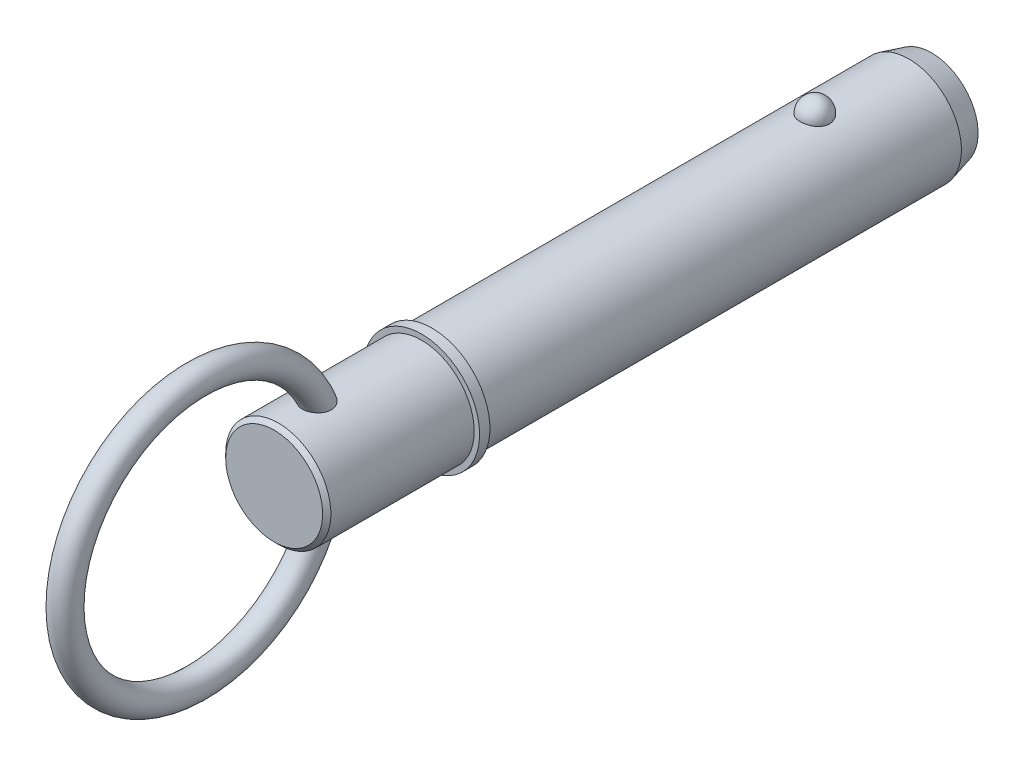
ISO-10303-21;
HEADER;
FILE_DESCRIPTION(('STEP AP214'),'2;1');
FILE_NAME('part.step','',(''),(''),'','','');
FILE_SCHEMA(('AUTOMOTIVE_DESIGN { 1 0 10303 214 1 1 1 1 }'));
ENDSEC;
DATA;
#1=APPLICATION_CONTEXT('core data for automotive mechanical design processes');
#2=APPLICATION_PROTOCOL_DEFINITION('international standard','automotive_design',2000,#1);
#3=PRODUCT_CONTEXT('',#1,'mechanical');
#4=PRODUCT('Part','Part','',(#3));
#5=PRODUCT_RELATED_PRODUCT_CATEGORY('part','',(#4));
#6=PRODUCT_DEFINITION_FORMATION('','',#4);
#7=PRODUCT_DEFINITION_CONTEXT('part definition',#1,'design');
#8=PRODUCT_DEFINITION('design','',#6,#7);
#9=PRODUCT_DEFINITION_SHAPE('','',#8);
#10=(LENGTH_UNIT() NAMED_UNIT(*) SI_UNIT(.MILLI.,.METRE.));
#11=(NAMED_UNIT(*) PLANE_ANGLE_UNIT() SI_UNIT($,.RADIAN.));
#12=(NAMED_UNIT(*) SI_UNIT($,.STERADIAN.) SOLID_ANGLE_UNIT());
#13=UNCERTAINTY_MEASURE_WITH_UNIT(LENGTH_MEASURE(1.E-05),#10,'distance_accuracy_value','');
#14=(GEOMETRIC_REPRESENTATION_CONTEXT(3) GLOBAL_UNCERTAINTY_ASSIGNED_CONTEXT((#13)) GLOBAL_UNIT_ASSIGNED_CONTEXT((#10,
#11,#12)) REPRESENTATION_CONTEXT('',''));
#15=CARTESIAN_POINT('',(0.,0.,0.));
#16=DIRECTION('',(0.,0.,1.));
#17=DIRECTION('',(1.,0.,0.));
#18=AXIS2_PLACEMENT_3D('',#15,#16,#17);
#19=CARTESIAN_POINT('',(0.,0.,88.9));
#20=DIRECTION('',(0.,0.,-1.));
#21=DIRECTION('',(-1.,0.,0.));
#22=AXIS2_PLACEMENT_3D('',#19,#20,#21);
#23=CYLINDRICAL_SURFACE('',#22,12.7);
#24=CARTESIAN_POINT('',(3.52486003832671,12.2010393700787,-3.56));
#25=CARTESIAN_POINT('',(3.52485671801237,12.2010422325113,-3.3610062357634));
#26=CARTESIAN_POINT('',(3.50863187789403,12.2057632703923,-3.16197042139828));
#27=CARTESIAN_POINT('',(3.4441205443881,12.2241207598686,-2.76953945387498));
#28=CARTESIAN_POINT('',(3.39582213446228,12.2377605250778,-2.57614642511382));
#29=CARTESIAN_POINT('',(3.26839193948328,12.2724057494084,-2.20059799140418));
#30=CARTESIAN_POINT('',(3.18927369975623,12.2934079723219,-2.01843769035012));
#31=CARTESIAN_POINT('',(3.00217139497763,12.3404306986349,-1.6703228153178));
#32=CARTESIAN_POINT('',(2.89418796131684,12.3664510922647,-1.50436788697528));
#33=CARTESIAN_POINT('',(2.65144862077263,12.4207616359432,-1.19241975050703));
#34=CARTESIAN_POINT('',(2.51656310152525,12.4490623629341,-1.04652919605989));
#35=CARTESIAN_POINT('',(2.22383249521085,12.5046678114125,-0.779711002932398));
#36=CARTESIAN_POINT('',(2.0659873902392,12.5319725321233,-0.658783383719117));
#37=CARTESIAN_POINT('',(1.73204520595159,12.5824645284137,-0.445586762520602));
#38=CARTESIAN_POINT('',(1.55600183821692,12.6056634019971,-0.353236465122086));
#39=CARTESIAN_POINT('',(1.19021695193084,12.6454411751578,-0.199381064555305));
#40=CARTESIAN_POINT('',(1.00047694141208,12.6620208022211,-0.137872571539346));
#41=CARTESIAN_POINT('',(0.616329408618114,12.6864692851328,-0.0483191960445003));
#42=CARTESIAN_POINT('',(0.422067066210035,12.6944893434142,-0.0196927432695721));
#43=CARTESIAN_POINT('',(0.0313259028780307,12.7014637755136,0.00524116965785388));
#44=CARTESIAN_POINT('',(-0.165152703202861,12.7004190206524,0.00155173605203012));
#45=CARTESIAN_POINT('',(-0.551780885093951,12.6894611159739,-0.0377454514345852));
#46=CARTESIAN_POINT('',(-0.74198078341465,12.6796749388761,-0.0728962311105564));
#47=CARTESIAN_POINT('',(-1.11361063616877,12.6524544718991,-0.173489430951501));
#48=CARTESIAN_POINT('',(-1.29504043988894,12.6350200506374,-0.238932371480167));
#49=CARTESIAN_POINT('',(-1.64521311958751,12.5942270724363,-0.398772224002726));
#50=CARTESIAN_POINT('',(-1.81387645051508,12.5708347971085,-0.493334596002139));
#51=CARTESIAN_POINT('',(-2.13292959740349,12.5206522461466,-0.708731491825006));
#52=CARTESIAN_POINT('',(-2.28331755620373,12.4938616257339,-0.829568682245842));
#53=CARTESIAN_POINT('',(-2.56470285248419,12.4391828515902,-1.0968714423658));
#54=CARTESIAN_POINT('',(-2.69527522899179,12.4112835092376,-1.24378221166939));
#55=CARTESIAN_POINT('',(-2.93023079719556,12.3579248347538,-1.55763192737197));
#56=CARTESIAN_POINT('',(-3.03461212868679,12.3324656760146,-1.72457229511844));
#57=CARTESIAN_POINT('',(-3.21564423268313,12.2865167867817,-2.07598316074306));
#58=CARTESIAN_POINT('',(-3.29196222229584,12.2660875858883,-2.26063321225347));
#59=CARTESIAN_POINT('',(-3.41323771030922,12.2328979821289,-2.64061334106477));
#60=CARTESIAN_POINT('',(-3.45819611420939,12.2201373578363,-2.83594310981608));
#61=CARTESIAN_POINT('',(-3.51550038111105,12.2037762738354,-3.2308649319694));
#62=CARTESIAN_POINT('',(-3.5279827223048,12.200137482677,-3.43043558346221));
#63=CARTESIAN_POINT('',(-3.52041430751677,12.2023234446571,-3.8289025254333));
#64=CARTESIAN_POINT('',(-3.50036443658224,12.2081479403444,-4.02779883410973));
#65=CARTESIAN_POINT('',(-3.42842010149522,12.2285446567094,-4.41824213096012));
#66=CARTESIAN_POINT('',(-3.37668525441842,12.243073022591,-4.6098208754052));
#67=CARTESIAN_POINT('',(-3.24279085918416,12.2792134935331,-4.98132360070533));
#68=CARTESIAN_POINT('',(-3.16063009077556,12.300825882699,-5.16124711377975));
#69=CARTESIAN_POINT('',(-2.96738224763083,12.3488691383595,-5.50542856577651));
#70=CARTESIAN_POINT('',(-2.85613997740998,12.3753256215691,-5.66959579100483));
#71=CARTESIAN_POINT('',(-2.60773241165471,12.4300386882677,-5.97665065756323));
#72=CARTESIAN_POINT('',(-2.47056612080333,12.458295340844,-6.11953748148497));
#73=CARTESIAN_POINT('',(-2.17327999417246,12.5135827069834,-6.38059312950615));
#74=CARTESIAN_POINT('',(-2.01307652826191,12.5406084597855,-6.49866785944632));
#75=CARTESIAN_POINT('',(-1.67442544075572,12.5902954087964,-6.70609314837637));
#76=CARTESIAN_POINT('',(-1.49597909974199,12.6129569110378,-6.79544572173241));
#77=CARTESIAN_POINT('',(-1.12819666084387,12.6511224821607,-6.94192787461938));
#78=CARTESIAN_POINT('',(-0.93902400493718,12.666712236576,-6.99944518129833));
#79=CARTESIAN_POINT('',(-0.553267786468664,12.6894125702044,-7.08227444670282));
#80=CARTESIAN_POINT('',(-0.356685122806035,12.6965241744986,-7.10759029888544));
#81=CARTESIAN_POINT('',(0.0343320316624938,12.7014305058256,-7.12510946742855));
#82=CARTESIAN_POINT('',(0.228736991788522,12.6993986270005,-7.11792901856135));
#83=CARTESIAN_POINT('',(0.613493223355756,12.6866339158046,-7.07206766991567));
#84=CARTESIAN_POINT('',(0.803844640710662,12.6759013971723,-7.03338790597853));
#85=CARTESIAN_POINT('',(1.17440741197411,12.6469443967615,-6.925834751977));
#86=CARTESIAN_POINT('',(1.35465462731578,12.6287486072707,-6.85707692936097));
#87=CARTESIAN_POINT('',(1.70092526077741,12.5867908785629,-6.69128257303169));
#88=CARTESIAN_POINT('',(1.86694777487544,12.5630285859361,-6.59424424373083));
#89=CARTESIAN_POINT('',(2.18289085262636,12.5120350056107,-6.3727748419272));
#90=CARTESIAN_POINT('',(2.33252391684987,12.4847559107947,-6.24794475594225));
#91=CARTESIAN_POINT('',(2.60889724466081,12.4299457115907,-5.97511730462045));
#92=CARTESIAN_POINT('',(2.73563353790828,12.4024145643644,-5.82711592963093));
#93=CARTESIAN_POINT('',(2.96505559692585,12.3495984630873,-5.5091226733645));
#94=CARTESIAN_POINT('',(3.06728335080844,12.3243610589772,-5.33879227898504));
#95=CARTESIAN_POINT('',(3.24218794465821,12.2795120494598,-4.98295005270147));
#96=CARTESIAN_POINT('',(3.31487538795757,12.2598984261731,-4.79744369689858));
#97=CARTESIAN_POINT('',(3.42255689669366,12.2302435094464,-4.43775244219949));
#98=CARTESIAN_POINT('',(3.46085292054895,12.2193780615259,-4.264615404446));
#99=CARTESIAN_POINT('',(3.5120056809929,12.2047747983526,-3.9143299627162));
#100=CARTESIAN_POINT('',(3.52486299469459,12.2010368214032,-3.73718164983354));
#101=CARTESIAN_POINT('',(3.52486003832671,12.2010393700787,-3.56));
#102=B_SPLINE_CURVE_WITH_KNOTS('',3,(#24,#25,#26,#27,#28,#29,#30,#31,#32,#33,#34,#35,#36,#37,
#38,#39,#40,#41,#42,#43,#44,#45,#46,#47,#48,#49,#50,#51,#52,#53,#54,#55,#56,#57,#58,#59,#60,#61,
#62,#63,#64,#65,#66,#67,#68,#69,#70,#71,#72,#73,#74,#75,#76,#77,#78,#79,#80,#81,#82,#83,#84,#85,
#86,#87,#88,#89,#90,#91,#92,#93,#94,#95,#96,#97,#98,#99,#100,#101),.UNSPECIFIED.,.T.,.F.,(4,2,2,
2,2,2,2,2,2,2,2,2,2,2,2,2,2,2,2,2,2,2,2,2,2,2,2,2,2,2,2,2,2,2,2,2,2,2,4),(0.,0.596344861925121,
1.19291141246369,1.78921606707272,2.38550767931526,2.98474477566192,3.58398233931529,
4.18149920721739,4.77895038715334,5.36566361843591,5.95232045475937,6.53059198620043,
7.10887345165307,7.6905033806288,8.27219236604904,8.86498552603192,9.45782077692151,
10.0574751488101,10.6571122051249,11.2542252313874,11.8513220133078,12.4454353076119,
13.0395724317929,13.636947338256,14.2343451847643,14.8339691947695,15.4335511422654,
16.0256602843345,16.6176978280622,17.1985559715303,17.7793931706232,18.3580179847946,
18.9366795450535,19.5242567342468,20.1119357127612,20.7098642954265,21.3075780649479,
21.8385683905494,22.3695466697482),.UNSPECIFIED.);
#103=CARTESIAN_POINT('',(3.52486003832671,12.2010393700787,-3.56));
#104=VERTEX_POINT('',#103);
#105=EDGE_CURVE('E102',#104,#104,#102,.T.);
#106=ORIENTED_EDGE('',*,*,#105,.T.);
#107=EDGE_LOOP('',(#106));
#108=FACE_BOUND('',#107,.T.);
#109=CARTESIAN_POINT('',(0.,0.,-26.2499999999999));
#110=DIRECTION('',(0.,0.,-1.));
#111=DIRECTION('',(-1.,0.,0.));
#112=AXIS2_PLACEMENT_3D('',#109,#110,#111);
#113=CIRCLE('',#112,12.7);
#114=CARTESIAN_POINT('',(-12.7,0.,-26.2499999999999));
#115=VERTEX_POINT('',#114);
#116=EDGE_CURVE('E110',#115,#115,#113,.F.);
#117=ORIENTED_EDGE('',*,*,#116,.T.);
#118=EDGE_LOOP('',(#117));
#119=FACE_BOUND('',#118,.T.);
#120=CARTESIAN_POINT('',(0.,0.,88.9));
#121=DIRECTION('',(0.,0.,1.));
#122=DIRECTION('',(1.,0.,0.));
#123=AXIS2_PLACEMENT_3D('',#120,#121,#122);
#124=CIRCLE('',#123,12.7);
#125=CARTESIAN_POINT('',(12.7,0.,88.9));
#126=VERTEX_POINT('',#125);
#127=EDGE_CURVE('E108',#126,#126,#124,.T.);
#128=ORIENTED_EDGE('',*,*,#127,.F.);
#129=EDGE_LOOP('',(#128));
#130=FACE_BOUND('',#129,.T.);
#131=ADVANCED_FACE('F39',(#108,#119,#130),#23,.T.);
#132=CARTESIAN_POINT('',(0.,0.,-31.75));
#133=DIRECTION('',(0.,0.,-1.));
#134=DIRECTION('',(-1.,0.,0.));
#135=AXIS2_PLACEMENT_3D('',#132,#133,#134);
#136=PLANE('',#135);
#137=CARTESIAN_POINT('',(0.,0.,-31.75));
#138=DIRECTION('',(0.,0.,-1.));
#139=DIRECTION('',(-1.,0.,0.));
#140=AXIS2_PLACEMENT_3D('',#137,#138,#139);
#141=CIRCLE('',#140,11.2262794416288);
#142=CARTESIAN_POINT('',(-11.2262794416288,0.,-31.75));
#143=VERTEX_POINT('',#142);
#144=EDGE_CURVE('E141',#143,#143,#141,.T.);
#145=ORIENTED_EDGE('',*,*,#144,.T.);
#146=EDGE_LOOP('',(#145));
#147=FACE_BOUND('',#146,.T.);
#148=ADVANCED_FACE('F88',(#147),#136,.T.);
#149=CARTESIAN_POINT('',(0.,0.,-31.75));
#150=DIRECTION('',(0.,0.,1.));
#151=DIRECTION('',(1.,0.,0.));
#152=AXIS2_PLACEMENT_3D('',#149,#150,#151);
#153=CONICAL_SURFACE('',#152,11.2262794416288,0.261799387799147);
#154=ORIENTED_EDGE('',*,*,#116,.F.);
#155=EDGE_LOOP('',(#154));
#156=FACE_BOUND('',#155,.T.);
#157=ORIENTED_EDGE('',*,*,#144,.F.);
#158=EDGE_LOOP('',(#157));
#159=FACE_BOUND('',#158,.T.);
#160=ADVANCED_FACE('F94',(#156,#159),#153,.T.);
#161=CARTESIAN_POINT('',(0.,12.7,-3.56));
#162=DIRECTION('',(0.,1.,0.));
#163=DIRECTION('',(0.,0.,1.));
#164=AXIS2_PLACEMENT_3D('',#161,#162,#163);
#165=SPHERICAL_SURFACE('',#164,3.56);
#166=ORIENTED_EDGE('',*,*,#105,.F.);
#167=EDGE_LOOP('',(#166));
#168=FACE_BOUND('',#167,.T.);
#169=ADVANCED_FACE('F113',(#168),#165,.T.);
#170=CARTESIAN_POINT('',(0.,0.,88.9));
#171=DIRECTION('',(0.,0.,-1.));
#172=DIRECTION('',(-1.,0.,0.));
#173=AXIS2_PLACEMENT_3D('',#170,#171,#172);
#174=PLANE('',#173);
#175=ORIENTED_EDGE('',*,*,#127,.T.);
#176=EDGE_LOOP('',(#175));
#177=FACE_BOUND('',#176,.T.);
#178=CARTESIAN_POINT('',(0.,0.,88.9));
#179=DIRECTION('',(0.,0.,-1.));
#180=DIRECTION('',(-1.,0.,0.));
#181=AXIS2_PLACEMENT_3D('',#178,#179,#180);
#182=CIRCLE('',#181,14.);
#183=CARTESIAN_POINT('',(-14.,0.,88.9));
#184=VERTEX_POINT('',#183);
#185=EDGE_CURVE('E109',#184,#184,#182,.T.);
#186=ORIENTED_EDGE('',*,*,#185,.T.);
#187=EDGE_LOOP('',(#186));
#188=FACE_BOUND('',#187,.T.);
#189=ADVANCED_FACE('F117',(#177,#188),#174,.T.);
#190=CARTESIAN_POINT('',(0.,0.,33.7287874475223));
#191=DIRECTION('',(0.,0.,-1.));
#192=DIRECTION('',(-1.,0.,0.));
#193=AXIS2_PLACEMENT_3D('',#190,#191,#192);
#194=CYLINDRICAL_SURFACE('',#193,14.);
#195=CARTESIAN_POINT('',(0.,0.,91.4));
#196=DIRECTION('',(0.,0.,-1.));
#197=DIRECTION('',(-1.,0.,0.));
#198=AXIS2_PLACEMENT_3D('',#195,#196,#197);
#199=CIRCLE('',#198,14.);
#200=CARTESIAN_POINT('',(-14.,0.,91.4));
#201=VERTEX_POINT('',#200);
#202=EDGE_CURVE('E134',#201,#201,#199,.T.);
#203=ORIENTED_EDGE('',*,*,#202,.T.);
#204=EDGE_LOOP('',(#203));
#205=FACE_BOUND('',#204,.T.);
#206=ORIENTED_EDGE('',*,*,#185,.F.);
#207=EDGE_LOOP('',(#206));
#208=FACE_BOUND('',#207,.T.);
#209=ADVANCED_FACE('F121',(#205,#208),#194,.T.);
#210=CARTESIAN_POINT('',(0.,14.,91.4));
#211=DIRECTION('',(0.,0.,1.));
#212=DIRECTION('',(1.,0.,0.));
#213=AXIS2_PLACEMENT_3D('',#210,#211,#212);
#214=PLANE('',#213);
#215=CARTESIAN_POINT('',(0.,0.,91.4));
#216=DIRECTION('',(0.,0.,1.));
#217=DIRECTION('',(1.,0.,0.));
#218=AXIS2_PLACEMENT_3D('',#215,#216,#217);
#219=CIRCLE('',#218,12.7);
#220=CARTESIAN_POINT('',(12.7,0.,91.4));
#221=VERTEX_POINT('',#220);
#222=EDGE_CURVE('E112',#221,#221,#219,.T.);
#223=ORIENTED_EDGE('',*,*,#222,.F.);
#224=EDGE_LOOP('',(#223));
#225=FACE_BOUND('',#224,.T.);
#226=ORIENTED_EDGE('',*,*,#202,.F.);
#227=EDGE_LOOP('',(#226));
#228=FACE_BOUND('',#227,.T.);
#229=ADVANCED_FACE('F85',(#225,#228),#214,.T.);
#230=CARTESIAN_POINT('',(0.,0.,127.));
#231=DIRECTION('',(0.,0.,-1.));
#232=DIRECTION('',(-1.,0.,0.));
#233=AXIS2_PLACEMENT_3D('',#230,#231,#232);
#234=CYLINDRICAL_SURFACE('',#233,12.7);
#235=CARTESIAN_POINT('',(-1.22892607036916,-12.6404011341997,113.37119395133));
#236=CARTESIAN_POINT('',(-1.06119922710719,-12.6567092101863,113.304004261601));
#237=CARTESIAN_POINT('',(-0.887663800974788,-12.6701810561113,113.250792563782));
#238=CARTESIAN_POINT('',(-0.53382313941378,-12.6900116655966,113.173419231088));
#239=CARTESIAN_POINT('',(-0.353518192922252,-12.6963707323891,113.1492563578));
#240=CARTESIAN_POINT('',(0.00871153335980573,-12.7012887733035,113.130519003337));
#241=CARTESIAN_POINT('',(0.190636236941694,-12.699848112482,113.135943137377));
#242=CARTESIAN_POINT('',(0.550971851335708,-12.6893231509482,113.176255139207));
#243=CARTESIAN_POINT('',(0.729382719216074,-12.6802387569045,113.21114336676));
#244=CARTESIAN_POINT('',(1.07771687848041,-12.6553960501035,113.309659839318));
#245=CARTESIAN_POINT('',(1.24763507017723,-12.6396337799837,113.373305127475));
#246=CARTESIAN_POINT('',(1.57398922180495,-12.6031560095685,113.527891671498));
#247=CARTESIAN_POINT('',(1.73042571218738,-12.5824407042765,113.618831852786));
#248=CARTESIAN_POINT('',(2.0246476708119,-12.5384554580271,113.825320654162));
#249=CARTESIAN_POINT('',(2.16251370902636,-12.5151974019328,113.94075697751));
#250=CARTESIAN_POINT('',(2.41652917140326,-12.4686447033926,114.193426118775));
#251=CARTESIAN_POINT('',(2.53268123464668,-12.4453500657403,114.330656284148));
#252=CARTESIAN_POINT('',(2.7397169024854,-12.4014166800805,114.62226178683));
#253=CARTESIAN_POINT('',(2.83072997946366,-12.3807646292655,114.776543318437));
#254=CARTESIAN_POINT('',(2.98642630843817,-12.3441356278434,115.098338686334));
#255=CARTESIAN_POINT('',(3.05110876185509,-12.3281588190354,115.265852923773));
#256=CARTESIAN_POINT('',(3.15450336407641,-12.3021148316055,115.612705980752));
#257=CARTESIAN_POINT('',(3.19268116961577,-12.2921697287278,115.792212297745));
#258=CARTESIAN_POINT('',(3.24150148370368,-12.2793848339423,116.155144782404));
#259=CARTESIAN_POINT('',(3.25213515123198,-12.2765473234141,116.338572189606));
#260=CARTESIAN_POINT('',(3.24696781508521,-12.2779158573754,116.718893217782));
#261=CARTESIAN_POINT('',(3.22910261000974,-12.2826719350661,116.915753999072));
#262=CARTESIAN_POINT('',(3.16504953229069,-12.2993299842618,117.30447917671));
#263=CARTESIAN_POINT('',(3.11884966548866,-12.3112349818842,117.496341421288));
#264=CARTESIAN_POINT('',(2.99323123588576,-12.3424162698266,117.892891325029));
#265=CARTESIAN_POINT('',(2.91059577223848,-12.3623844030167,118.096505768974));
#266=CARTESIAN_POINT('',(2.71447440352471,-12.4069229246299,118.488190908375));
#267=CARTESIAN_POINT('',(2.60094970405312,-12.431499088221,118.676241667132));
#268=CARTESIAN_POINT('',(2.40499526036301,-12.4703951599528,118.947470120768));
#269=CARTESIAN_POINT('',(2.3330184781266,-12.4841083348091,119.038407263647));
#270=CARTESIAN_POINT('',(2.18106597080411,-12.5115521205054,119.213320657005));
#271=CARTESIAN_POINT('',(2.10108885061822,-12.5252827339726,119.297295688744));
#272=CARTESIAN_POINT('',(1.84973962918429,-12.5657115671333,119.536779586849));
#273=CARTESIAN_POINT('',(1.66646770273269,-12.5917488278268,119.680526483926));
#274=CARTESIAN_POINT('',(1.33551340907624,-12.6303067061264,119.885856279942));
#275=CARTESIAN_POINT('',(1.19512135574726,-12.6444898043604,119.95902243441));
#276=CARTESIAN_POINT('',(0.903945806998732,-12.6686276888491,120.081586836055));
#277=CARTESIAN_POINT('',(0.75317336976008,-12.6785868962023,120.131009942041));
#278=CARTESIAN_POINT('',(0.444090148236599,-12.6931800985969,120.202942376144));
#279=CARTESIAN_POINT('',(0.285741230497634,-12.6977833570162,120.225296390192));
#280=CARTESIAN_POINT('',(-0.0324491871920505,-12.700953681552,120.240724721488));
#281=CARTESIAN_POINT('',(-0.192290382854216,-12.6995219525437,120.233804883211));
#282=CARTESIAN_POINT('',(-0.49382263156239,-12.6912132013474,120.193209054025));
#283=CARTESIAN_POINT('',(-0.635865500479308,-12.6848307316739,120.161962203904));
#284=CARTESIAN_POINT('',(-0.913041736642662,-12.6678986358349,120.077721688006));
#285=CARTESIAN_POINT('',(-1.04817349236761,-12.6573480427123,120.024722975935));
#286=CARTESIAN_POINT('',(-1.31637898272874,-12.6323524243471,119.896233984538));
#287=CARTESIAN_POINT('',(-1.44890088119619,-12.6177203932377,119.819638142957));
#288=CARTESIAN_POINT('',(-1.70162176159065,-12.5861326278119,119.648743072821));
#289=CARTESIAN_POINT('',(-1.82181486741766,-12.569175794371,119.554435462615));
#290=CARTESIAN_POINT('',(-2.06961284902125,-12.5309682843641,119.332665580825));
#291=CARTESIAN_POINT('',(-2.19457628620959,-12.5094982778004,119.20229330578));
#292=CARTESIAN_POINT('',(-2.42503767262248,-12.4668738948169,118.925308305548));
#293=CARTESIAN_POINT('',(-2.53052086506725,-12.4457197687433,118.778683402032));
#294=CARTESIAN_POINT('',(-2.73961150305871,-12.4015349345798,118.443065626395));
#295=CARTESIAN_POINT('',(-2.83895917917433,-12.3789253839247,118.251346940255));
#296=CARTESIAN_POINT('',(-3.00725804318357,-12.3391195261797,117.854405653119));
#297=CARTESIAN_POINT('',(-3.07618857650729,-12.3219268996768,117.649173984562));
#298=CARTESIAN_POINT('',(-3.18528660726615,-12.2942052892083,117.213754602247));
#299=CARTESIAN_POINT('',(-3.22287145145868,-12.2842816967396,116.982855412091));
#300=CARTESIAN_POINT('',(-3.24821271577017,-12.2775854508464,116.634351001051));
#301=CARTESIAN_POINT('',(-3.25148236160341,-12.276719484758,116.517777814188));
#302=CARTESIAN_POINT('',(-3.24729041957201,-12.2778310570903,116.284859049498));
#303=CARTESIAN_POINT('',(-3.23983534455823,-12.2798068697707,116.168513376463));
#304=CARTESIAN_POINT('',(-3.21488959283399,-12.286359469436,115.94622762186));
#305=CARTESIAN_POINT('',(-3.19823165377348,-12.2907201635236,115.840186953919));
#306=CARTESIAN_POINT('',(-3.15537465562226,-12.3017926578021,115.63022257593));
#307=CARTESIAN_POINT('',(-3.12918076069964,-12.3085031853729,115.526297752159));
#308=CARTESIAN_POINT('',(-3.06721568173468,-12.3240904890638,115.321553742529));
#309=CARTESIAN_POINT('',(-3.03144854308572,-12.3329663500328,115.220733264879));
#310=CARTESIAN_POINT('',(-2.95042598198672,-12.3525998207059,115.023171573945));
#311=CARTESIAN_POINT('',(-2.90517160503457,-12.3633572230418,114.926429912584));
#312=CARTESIAN_POINT('',(-2.81116315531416,-12.3850478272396,114.748857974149));
#313=CARTESIAN_POINT('',(-2.76340897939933,-12.3958187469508,114.667476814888));
#314=CARTESIAN_POINT('',(-2.66091958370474,-12.4182228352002,114.509317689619));
#315=CARTESIAN_POINT('',(-2.60618212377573,-12.4298562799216,114.432541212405));
#316=CARTESIAN_POINT('',(-2.49013138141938,-12.4536239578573,114.284278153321));
#317=CARTESIAN_POINT('',(-2.42882150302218,-12.4657579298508,114.212788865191));
#318=CARTESIAN_POINT('',(-2.30002146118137,-12.4901640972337,114.075587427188));
#319=CARTESIAN_POINT('',(-2.23252894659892,-12.5024363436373,114.009877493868));
#320=CARTESIAN_POINT('',(-2.09370795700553,-12.5264205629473,113.886377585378));
#321=CARTESIAN_POINT('',(-2.02252382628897,-12.5381388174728,113.828426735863));
#322=CARTESIAN_POINT('',(-1.87531735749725,-12.5610012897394,113.71889123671));
#323=CARTESIAN_POINT('',(-1.79929316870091,-12.5721452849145,113.667309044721));
#324=CARTESIAN_POINT('',(-1.56485282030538,-12.6042047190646,113.522706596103));
#325=CARTESIAN_POINT('',(-1.39990754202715,-12.6237766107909,113.439687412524));
#326=CARTESIAN_POINT('',(-1.22892607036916,-12.6404011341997,113.37119395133));
#327=B_SPLINE_CURVE_WITH_KNOTS('',3,(#235,#236,#237,#238,#239,#240,#241,#242,#243,#244,#245,
#246,#247,#248,#249,#250,#251,#252,#253,#254,#255,#256,#257,#258,#259,#260,#261,#262,#263,#264,
#265,#266,#267,#268,#269,#270,#271,#272,#273,#274,#275,#276,#277,#278,#279,#280,#281,#282,#283,
#284,#285,#286,#287,#288,#289,#290,#291,#292,#293,#294,#295,#296,#297,#298,#299,#300,#301,#302,
#303,#304,#305,#306,#307,#308,#309,#310,#311,#312,#313,#314,#315,#316,#317,#318,#319,#320,#321,
#322,#323,#324,#325,#326),.UNSPECIFIED.,.T.,.F.,(4,2,2,2,2,2,2,2,2,2,2,2,2,2,2,2,2,2,2,2,2,2,2,
2,2,2,2,2,2,2,2,2,2,2,2,2,2,2,2,2,2,2,2,2,2,4),(0.,0.543509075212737,1.08699497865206,
1.63045544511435,2.17392254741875,2.71771216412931,3.26148037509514,3.8028076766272,
4.34406914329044,4.88248866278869,5.42092451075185,5.96992270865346,6.51909710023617,
7.10988630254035,7.70092576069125,8.36013748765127,9.02018098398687,9.37009147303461,
9.72006308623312,10.4175255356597,10.8925536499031,11.3670833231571,11.844322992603,
12.3214673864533,12.7562647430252,13.1911630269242,13.6507378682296,14.110530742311,
14.6541210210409,15.198121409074,15.8467121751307,16.4957426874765,17.1940750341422,
17.5435132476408,17.8927393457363,18.2145822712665,18.5362511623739,18.8577843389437,
19.1792821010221,19.463832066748,19.7484735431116,20.0329683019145,20.3175717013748,
20.5948148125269,20.8721645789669,21.4262200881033),.UNSPECIFIED.);
#328=CARTESIAN_POINT('',(-1.22892607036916,-12.6404011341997,113.37119395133));
#329=VERTEX_POINT('',#328);
#330=EDGE_CURVE('E10',#329,#329,#327,.T.);
#331=ORIENTED_EDGE('',*,*,#330,.F.);
#332=EDGE_LOOP('',(#331));
#333=FACE_BOUND('',#332,.T.);
#334=CARTESIAN_POINT('',(-1.22892607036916,12.6404011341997,113.37119395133));
#335=CARTESIAN_POINT('',(-1.39512541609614,12.624240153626,113.43776712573));
#336=CARTESIAN_POINT('',(-1.55582432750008,12.6052778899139,113.518153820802));
#337=CARTESIAN_POINT('',(-1.86136954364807,12.5638060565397,113.704658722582));
#338=CARTESIAN_POINT('',(-2.00617769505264,12.5412882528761,113.810836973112));
#339=CARTESIAN_POINT('',(-2.27547906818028,12.4952333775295,114.046103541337));
#340=CARTESIAN_POINT('',(-2.39998742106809,12.4716970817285,114.175174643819));
#341=CARTESIAN_POINT('',(-2.62534229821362,12.4262157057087,114.452623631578));
#342=CARTESIAN_POINT('',(-2.72620384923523,12.4042696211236,114.600989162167));
#343=CARTESIAN_POINT('',(-2.90197976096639,12.3643304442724,114.9126750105));
#344=CARTESIAN_POINT('',(-2.97691335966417,12.346334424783,115.075984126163));
#345=CARTESIAN_POINT('',(-3.09983588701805,12.3160482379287,115.412927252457));
#346=CARTESIAN_POINT('',(-3.14781852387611,12.3037594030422,115.586563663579));
#347=CARTESIAN_POINT('',(-3.21809353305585,12.2855709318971,115.945523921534));
#348=CARTESIAN_POINT('',(-3.23943500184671,12.2799082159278,116.131044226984));
#349=CARTESIAN_POINT('',(-3.2544382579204,12.2759385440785,116.503232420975));
#350=CARTESIAN_POINT('',(-3.24809142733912,12.2776338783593,116.689900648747));
#351=CARTESIAN_POINT('',(-3.20755159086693,12.288291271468,117.077577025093));
#352=CARTESIAN_POINT('',(-3.17081691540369,12.2979162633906,117.278299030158));
#353=CARTESIAN_POINT('',(-3.06845850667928,12.3238513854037,117.671858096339));
#354=CARTESIAN_POINT('',(-3.00281105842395,12.3401670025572,117.864688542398));
#355=CARTESIAN_POINT('',(-2.83560995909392,12.3797223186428,118.259473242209));
#356=CARTESIAN_POINT('',(-2.73085133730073,12.4035339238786,118.460019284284));
#357=CARTESIAN_POINT('',(-2.48976141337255,12.4541651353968,118.840813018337));
#358=CARTESIAN_POINT('',(-2.35343772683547,12.4809840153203,119.021065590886));
#359=CARTESIAN_POINT('',(-2.07683984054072,12.5296806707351,119.32565995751));
#360=CARTESIAN_POINT('',(-1.94129351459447,12.551613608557,119.454283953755));
#361=CARTESIAN_POINT('',(-1.65081707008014,12.5931023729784,119.687836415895));
#362=CARTESIAN_POINT('',(-1.49591505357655,12.6126615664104,119.792798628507));
#363=CARTESIAN_POINT('',(-1.19690065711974,12.6442092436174,119.957788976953));
#364=CARTESIAN_POINT('',(-1.05541267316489,12.6569190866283,120.022418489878));
#365=CARTESIAN_POINT('',(-0.763415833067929,12.6778764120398,120.127638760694));
#366=CARTESIAN_POINT('',(-0.612913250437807,12.6861269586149,120.168246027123));
#367=CARTESIAN_POINT('',(-0.306168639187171,12.697239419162,120.222715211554));
#368=CARTESIAN_POINT('',(-0.14990366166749,12.7000767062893,120.236454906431));
#369=CARTESIAN_POINT('',(0.16255262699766,12.699920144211,120.23569423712));
#370=CARTESIAN_POINT('',(0.318743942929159,12.6969267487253,120.221196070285));
#371=CARTESIAN_POINT('',(0.614555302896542,12.6859231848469,120.167234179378));
#372=CARTESIAN_POINT('',(0.754548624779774,12.6782987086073,120.129687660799));
#373=CARTESIAN_POINT('',(1.02685044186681,12.6591561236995,120.033711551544));
#374=CARTESIAN_POINT('',(1.15915690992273,12.6476369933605,119.975276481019));
#375=CARTESIAN_POINT('',(1.42405861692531,12.6206654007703,119.834988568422));
#376=CARTESIAN_POINT('',(1.55582877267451,12.604971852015,119.751635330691));
#377=CARTESIAN_POINT('',(1.80621935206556,12.571537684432,119.567498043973));
#378=CARTESIAN_POINT('',(1.92483289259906,12.5537960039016,119.466704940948));
#379=CARTESIAN_POINT('',(2.16936918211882,12.5140714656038,119.230174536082));
#380=CARTESIAN_POINT('',(2.2923642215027,12.4919255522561,119.091439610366));
#381=CARTESIAN_POINT('',(2.51762485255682,12.4484835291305,118.797913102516));
#382=CARTESIAN_POINT('',(2.61987416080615,12.4271880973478,118.643109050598));
#383=CARTESIAN_POINT('',(2.8195630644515,12.3835520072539,118.291316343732));
#384=CARTESIAN_POINT('',(2.91268031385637,12.3617361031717,118.091798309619));
#385=CARTESIAN_POINT('',(3.06675738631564,12.3244204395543,117.679898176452));
#386=CARTESIAN_POINT('',(3.12769905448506,12.3089242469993,117.467508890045));
#387=CARTESIAN_POINT('',(3.19410612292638,12.2917937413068,117.137729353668));
#388=CARTESIAN_POINT('',(3.21217746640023,12.2870696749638,117.022917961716));
#389=CARTESIAN_POINT('',(3.23822570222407,12.2802317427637,116.792095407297));
#390=CARTESIAN_POINT('',(3.24620727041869,12.2781166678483,116.67608482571));
#391=CARTESIAN_POINT('',(3.25166839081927,12.2766712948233,116.44381042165));
#392=CARTESIAN_POINT('',(3.24914931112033,12.2773406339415,116.327546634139));
#393=CARTESIAN_POINT('',(3.23325304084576,12.2815367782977,116.095869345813));
#394=CARTESIAN_POINT('',(3.21988260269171,12.2850618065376,115.98045536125));
#395=CARTESIAN_POINT('',(3.18378347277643,12.2944635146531,115.762188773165));
#396=CARTESIAN_POINT('',(3.16203615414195,12.3000921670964,115.659162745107));
#397=CARTESIAN_POINT('',(3.109310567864,12.3135262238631,115.455694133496));
#398=CARTESIAN_POINT('',(3.07833729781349,12.3213304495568,115.35525018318));
#399=CARTESIAN_POINT('',(3.00719503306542,12.3388864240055,115.157882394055));
#400=CARTESIAN_POINT('',(2.9670290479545,12.34863753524,115.060957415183));
#401=CARTESIAN_POINT('',(2.87766260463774,12.3697681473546,114.87155308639));
#402=CARTESIAN_POINT('',(2.82846300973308,12.3811474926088,114.779073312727));
#403=CARTESIAN_POINT('',(2.72718770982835,12.4038233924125,114.609278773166));
#404=CARTESIAN_POINT('',(2.67601025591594,12.4149937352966,114.531409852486));
#405=CARTESIAN_POINT('',(2.56702778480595,12.4379850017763,114.380514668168));
#406=CARTESIAN_POINT('',(2.50922051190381,12.4498061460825,114.307490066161));
#407=CARTESIAN_POINT('',(2.38741431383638,12.4737362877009,114.166915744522));
#408=CARTESIAN_POINT('',(2.32341881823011,12.4858451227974,114.099363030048));
#409=CARTESIAN_POINT('',(2.18967865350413,12.5099935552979,113.970183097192));
#410=CARTESIAN_POINT('',(2.11993188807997,12.5220331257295,113.908558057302));
#411=CARTESIAN_POINT('',(1.90863625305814,12.5565453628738,113.737971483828));
#412=CARTESIAN_POINT('',(1.7599675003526,12.5784460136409,113.637508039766));
#413=CARTESIAN_POINT('',(1.44761854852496,12.6182083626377,113.462748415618));
#414=CARTESIAN_POINT('',(1.28394037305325,12.6360706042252,113.388448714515));
#415=CARTESIAN_POINT('',(0.945887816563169,12.6658634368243,113.267537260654));
#416=CARTESIAN_POINT('',(0.771499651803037,12.6777861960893,113.220962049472));
#417=CARTESIAN_POINT('',(0.417041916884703,12.694390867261,113.156673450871));
#418=CARTESIAN_POINT('',(0.236969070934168,12.6990685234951,113.138977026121));
#419=CARTESIAN_POINT('',(-0.124879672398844,12.7006841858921,113.132829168));
#420=CARTESIAN_POINT('',(-0.306658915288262,12.6975703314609,113.144573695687));
#421=CARTESIAN_POINT('',(-0.66529779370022,12.6838264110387,113.197473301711));
#422=CARTESIAN_POINT('',(-0.84216829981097,12.6732146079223,113.238556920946));
#423=CARTESIAN_POINT('',(-1.0502551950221,12.6565519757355,113.305394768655));
#424=CARTESIAN_POINT('',(-1.08632235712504,12.6535053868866,113.317681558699));
#425=CARTESIAN_POINT('',(-1.15798463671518,12.6471484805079,113.343501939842));
#426=CARTESIAN_POINT('',(-1.19357974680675,12.6438381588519,113.35703555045));
#427=CARTESIAN_POINT('',(-1.22892607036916,12.6404011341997,113.37119395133));
#428=B_SPLINE_CURVE_WITH_KNOTS('',3,(#334,#335,#336,#337,#338,#339,#340,#341,#342,#343,#344,
#345,#346,#347,#348,#349,#350,#351,#352,#353,#354,#355,#356,#357,#358,#359,#360,#361,#362,#363,
#364,#365,#366,#367,#368,#369,#370,#371,#372,#373,#374,#375,#376,#377,#378,#379,#380,#381,#382,
#383,#384,#385,#386,#387,#388,#389,#390,#391,#392,#393,#394,#395,#396,#397,#398,#399,#400,#401,
#402,#403,#404,#405,#406,#407,#408,#409,#410,#411,#412,#413,#414,#415,#416,#417,#418,#419,#420,
#421,#422,#423,#424,#425,#426,#427),.UNSPECIFIED.,.T.,.F.,(4,2,2,2,2,2,2,2,2,2,2,2,2,2,2,2,2,2,
2,2,2,2,2,2,2,2,2,2,2,2,2,2,2,2,2,2,2,2,2,2,2,2,2,2,2,2,4),(0.,0.539146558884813,
1.07956050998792,1.61956978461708,2.15923496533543,2.69849886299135,3.23788860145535,
3.79602631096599,4.35433775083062,4.96471598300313,5.57559579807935,6.2550948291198,
6.93443009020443,7.49671429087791,8.05819140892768,8.52445959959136,8.99040698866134,
9.45846913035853,9.92649485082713,10.3600530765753,10.7937251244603,11.2621204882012,
11.7307597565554,12.2888675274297,12.8474116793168,13.5084064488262,14.1697737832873,
14.5183408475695,14.8667463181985,15.2151063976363,15.5632498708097,15.8791508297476,
16.1948809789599,16.5105079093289,16.826104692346,17.1072964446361,17.3885841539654,
17.669716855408,17.9509524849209,18.4904482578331,19.0298713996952,19.5700039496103,
20.1104536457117,20.6545101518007,21.1972460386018,21.3119068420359,21.4265694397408),.UNSPECIFIED.);
#429=CARTESIAN_POINT('',(-1.22892607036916,12.6404011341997,113.37119395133));
#430=VERTEX_POINT('',#429);
#431=EDGE_CURVE('E51',#430,#430,#428,.T.);
#432=ORIENTED_EDGE('',*,*,#431,.F.);
#433=EDGE_LOOP('',(#432));
#434=FACE_BOUND('',#433,.T.);
#435=CARTESIAN_POINT('',(0.,0.,126.));
#436=DIRECTION('',(0.,0.,-1.));
#437=DIRECTION('',(-1.,0.,0.));
#438=AXIS2_PLACEMENT_3D('',#435,#436,#437);
#439=CIRCLE('',#438,12.7);
#440=CARTESIAN_POINT('',(-12.7,0.,126.));
#441=VERTEX_POINT('',#440);
#442=EDGE_CURVE('E64',#441,#441,#439,.T.);
#443=ORIENTED_EDGE('',*,*,#442,.T.);
#444=EDGE_LOOP('',(#443));
#445=FACE_BOUND('',#444,.T.);
#446=ORIENTED_EDGE('',*,*,#222,.T.);
#447=EDGE_LOOP('',(#446));
#448=FACE_BOUND('',#447,.T.);
#449=ADVANCED_FACE('F69',(#333,#434,#445,#448),#234,.T.);
#450=CARTESIAN_POINT('',(0.,0.,127.));
#451=DIRECTION('',(0.,0.,-1.));
#452=DIRECTION('',(-1.,0.,0.));
#453=AXIS2_PLACEMENT_3D('',#450,#451,#452);
#454=PLANE('',#453);
#455=CARTESIAN_POINT('',(0.,0.,127.));
#456=DIRECTION('',(0.,0.,-1.));
#457=DIRECTION('',(-1.,0.,0.));
#458=AXIS2_PLACEMENT_3D('',#455,#456,#457);
#459=CIRCLE('',#458,11.6999999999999);
#460=CARTESIAN_POINT('',(-11.6999999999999,0.,127.));
#461=VERTEX_POINT('',#460);
#462=EDGE_CURVE('E58',#461,#461,#459,.F.);
#463=ORIENTED_EDGE('',*,*,#462,.T.);
#464=EDGE_LOOP('',(#463));
#465=FACE_BOUND('',#464,.T.);
#466=ADVANCED_FACE('F76',(#465),#454,.F.);
#467=CARTESIAN_POINT('',(0.,0.,126.));
#468=DIRECTION('',(0.,0.,-1.));
#469=DIRECTION('',(-1.,0.,0.));
#470=AXIS2_PLACEMENT_3D('',#467,#468,#469);
#471=CONICAL_SURFACE('',#470,12.7,0.785398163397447);
#472=ORIENTED_EDGE('',*,*,#462,.F.);
#473=EDGE_LOOP('',(#472));
#474=FACE_BOUND('',#473,.T.);
#475=ORIENTED_EDGE('',*,*,#442,.F.);
#476=EDGE_LOOP('',(#475));
#477=FACE_BOUND('',#476,.T.);
#478=ADVANCED_FACE('F41',(#474,#477),#471,.T.);
#479=CARTESIAN_POINT('',(0.,0.,145.75));
#480=DIRECTION('',(1.,0.,0.));
#481=DIRECTION('',(0.,0.,-1.));
#482=AXIS2_PLACEMENT_3D('',#479,#480,#481);
#483=TOROIDAL_SURFACE('',#482,31.75,3.25);
#484=ORIENTED_EDGE('',*,*,#330,.T.);
#485=EDGE_LOOP('',(#484));
#486=FACE_BOUND('',#485,.T.);
#487=ORIENTED_EDGE('',*,*,#431,.T.);
#488=EDGE_LOOP('',(#487));
#489=FACE_BOUND('',#488,.T.);
#490=ADVANCED_FACE('F73',(#486,#489),#483,.T.);
#491=CLOSED_SHELL('',(#131,#148,#160,#169,#189,#209,#229,#449,#466,#478,#490));
#492=MANIFOLD_SOLID_BREP('B2',#491);
#493=ADVANCED_BREP_SHAPE_REPRESENTATION('',(#18,#492),#14);
#494=SHAPE_DEFINITION_REPRESENTATION(#9,#493);
ENDSEC;
END-ISO-10303-21;
